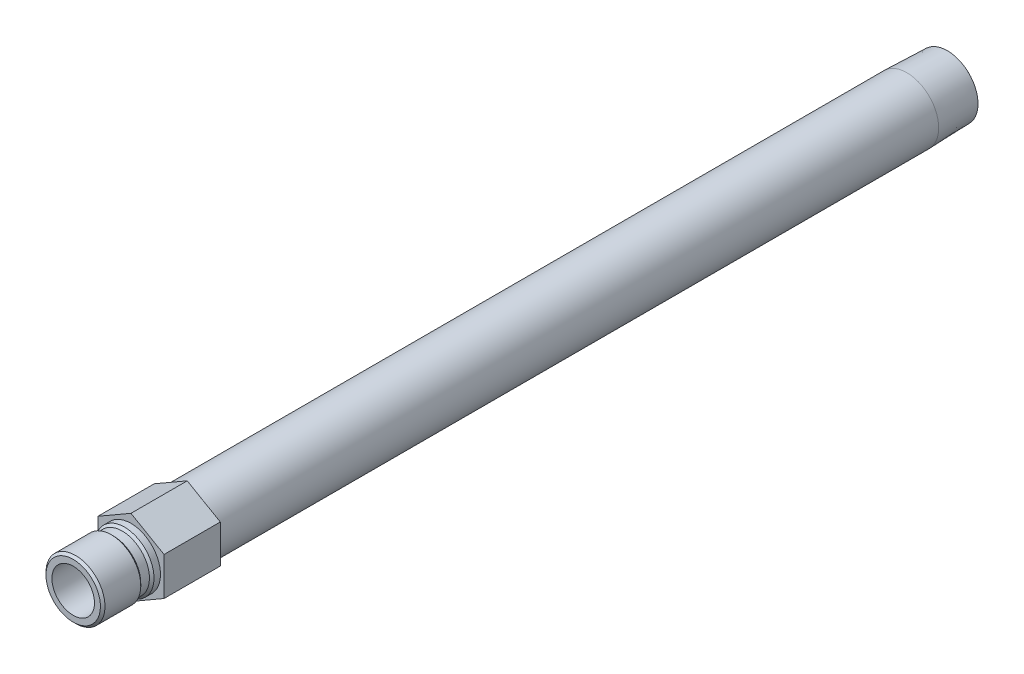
ISO-10303-21;
HEADER;
FILE_DESCRIPTION(('STEP AP214'),'2;1');
FILE_NAME('part.step','',(''),(''),'','','');
FILE_SCHEMA(('AUTOMOTIVE_DESIGN { 1 0 10303 214 1 1 1 1 }'));
ENDSEC;
DATA;
#1=APPLICATION_CONTEXT('core data for automotive mechanical design processes');
#2=APPLICATION_PROTOCOL_DEFINITION('international standard','automotive_design',2000,#1);
#3=PRODUCT_CONTEXT('',#1,'mechanical');
#4=PRODUCT('Part','Part','',(#3));
#5=PRODUCT_RELATED_PRODUCT_CATEGORY('part','',(#4));
#6=PRODUCT_DEFINITION_FORMATION('','',#4);
#7=PRODUCT_DEFINITION_CONTEXT('part definition',#1,'design');
#8=PRODUCT_DEFINITION('design','',#6,#7);
#9=PRODUCT_DEFINITION_SHAPE('','',#8);
#10=(LENGTH_UNIT() NAMED_UNIT(*) SI_UNIT(.MILLI.,.METRE.));
#11=(NAMED_UNIT(*) PLANE_ANGLE_UNIT() SI_UNIT($,.RADIAN.));
#12=(NAMED_UNIT(*) SI_UNIT($,.STERADIAN.) SOLID_ANGLE_UNIT());
#13=UNCERTAINTY_MEASURE_WITH_UNIT(LENGTH_MEASURE(1.E-05),#10,'distance_accuracy_value','');
#14=(GEOMETRIC_REPRESENTATION_CONTEXT(3) GLOBAL_UNCERTAINTY_ASSIGNED_CONTEXT((#13)) GLOBAL_UNIT_ASSIGNED_CONTEXT((#10,
#11,#12)) REPRESENTATION_CONTEXT('',''));
#15=CARTESIAN_POINT('',(0.,0.,0.));
#16=DIRECTION('',(0.,0.,1.));
#17=DIRECTION('',(1.,0.,0.));
#18=AXIS2_PLACEMENT_3D('',#15,#16,#17);
#19=CARTESIAN_POINT('',(0.,0.,0.));
#20=DIRECTION('',(0.,0.,-1.));
#21=DIRECTION('',(0.,1.,0.));
#22=AXIS2_PLACEMENT_3D('',#19,#20,#21);
#23=CYLINDRICAL_SURFACE('',#22,7.112);
#24=CARTESIAN_POINT('',(0.,0.,1.524));
#25=DIRECTION('',(0.,0.,-1.));
#26=DIRECTION('',(0.,1.,0.));
#27=AXIS2_PLACEMENT_3D('',#24,#25,#26);
#28=CIRCLE('',#27,7.112);
#29=CARTESIAN_POINT('',(0.,7.112,1.524));
#30=VERTEX_POINT('',#29);
#31=EDGE_CURVE('E147',#30,#30,#28,.T.);
#32=ORIENTED_EDGE('',*,*,#31,.T.);
#33=EDGE_LOOP('',(#32));
#34=FACE_BOUND('',#33,.T.);
#35=CARTESIAN_POINT('',(0.,0.,19.304));
#36=DIRECTION('',(0.,0.,-1.));
#37=DIRECTION('',(0.,1.,0.));
#38=AXIS2_PLACEMENT_3D('',#35,#36,#37);
#39=CIRCLE('',#38,7.112);
#40=CARTESIAN_POINT('',(0.,7.112,19.304));
#41=VERTEX_POINT('',#40);
#42=EDGE_CURVE('E42',#41,#41,#39,.T.);
#43=ORIENTED_EDGE('',*,*,#42,.F.);
#44=EDGE_LOOP('',(#43));
#45=FACE_BOUND('',#44,.T.);
#46=ADVANCED_FACE('F33',(#34,#45),#23,.F.);
#47=CARTESIAN_POINT('',(0.,7.112,19.304));
#48=DIRECTION('',(0.,0.,1.));
#49=DIRECTION('',(0.,-1.,0.));
#50=AXIS2_PLACEMENT_3D('',#47,#48,#49);
#51=PLANE('',#50);
#52=ORIENTED_EDGE('',*,*,#42,.T.);
#53=EDGE_LOOP('',(#52));
#54=FACE_BOUND('',#53,.T.);
#55=CARTESIAN_POINT('',(0.,0.,19.304));
#56=DIRECTION('',(0.,0.,-1.));
#57=DIRECTION('',(0.,1.,0.));
#58=AXIS2_PLACEMENT_3D('',#55,#56,#57);
#59=CIRCLE('',#58,9.0932);
#60=CARTESIAN_POINT('',(0.,9.0932,19.304));
#61=VERTEX_POINT('',#60);
#62=EDGE_CURVE('E180',#61,#61,#59,.T.);
#63=ORIENTED_EDGE('',*,*,#62,.F.);
#64=EDGE_LOOP('',(#63));
#65=FACE_BOUND('',#64,.T.);
#66=ADVANCED_FACE('F186',(#54,#65),#51,.T.);
#67=CARTESIAN_POINT('',(0.,0.,18.542));
#68=DIRECTION('',(0.,0.,-1.));
#69=DIRECTION('',(0.,1.,0.));
#70=AXIS2_PLACEMENT_3D('',#67,#68,#69);
#71=CONICAL_SURFACE('',#70,9.8552,0.785398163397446);
#72=ORIENTED_EDGE('',*,*,#62,.T.);
#73=EDGE_LOOP('',(#72));
#74=FACE_BOUND('',#73,.T.);
#75=CARTESIAN_POINT('',(0.,0.,18.542));
#76=DIRECTION('',(0.,0.,-1.));
#77=DIRECTION('',(0.,1.,0.));
#78=AXIS2_PLACEMENT_3D('',#75,#76,#77);
#79=CIRCLE('',#78,9.8552);
#80=CARTESIAN_POINT('',(0.,9.8552,18.542));
#81=VERTEX_POINT('',#80);
#82=EDGE_CURVE('E177',#81,#81,#79,.T.);
#83=ORIENTED_EDGE('',*,*,#82,.F.);
#84=EDGE_LOOP('',(#83));
#85=FACE_BOUND('',#84,.T.);
#86=ADVANCED_FACE('F194',(#74,#85),#71,.T.);
#87=CARTESIAN_POINT('',(0.,0.,0.));
#88=DIRECTION('',(0.,0.,-1.));
#89=DIRECTION('',(0.,1.,0.));
#90=AXIS2_PLACEMENT_3D('',#87,#88,#89);
#91=CYLINDRICAL_SURFACE('',#90,9.8552);
#92=ORIENTED_EDGE('',*,*,#82,.T.);
#93=EDGE_LOOP('',(#92));
#94=FACE_BOUND('',#93,.T.);
#95=CARTESIAN_POINT('',(0.,0.,6.5786));
#96=DIRECTION('',(0.,0.,-1.));
#97=DIRECTION('',(0.,1.,0.));
#98=AXIS2_PLACEMENT_3D('',#95,#96,#97);
#99=CIRCLE('',#98,9.8552);
#100=CARTESIAN_POINT('',(0.,9.8552,6.5786));
#101=VERTEX_POINT('',#100);
#102=EDGE_CURVE('E174',#101,#101,#99,.T.);
#103=ORIENTED_EDGE('',*,*,#102,.F.);
#104=EDGE_LOOP('',(#103));
#105=FACE_BOUND('',#104,.T.);
#106=ADVANCED_FACE('F249',(#94,#105),#91,.T.);
#107=CARTESIAN_POINT('',(0.,0.,5.8166));
#108=DIRECTION('',(0.,0.,1.));
#109=DIRECTION('',(0.,-1.,0.));
#110=AXIS2_PLACEMENT_3D('',#107,#108,#109);
#111=CONICAL_SURFACE('',#110,9.0932,0.785398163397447);
#112=ORIENTED_EDGE('',*,*,#102,.T.);
#113=EDGE_LOOP('',(#112));
#114=FACE_BOUND('',#113,.T.);
#115=CARTESIAN_POINT('',(0.,0.,5.8166));
#116=DIRECTION('',(0.,0.,-1.));
#117=DIRECTION('',(0.,1.,0.));
#118=AXIS2_PLACEMENT_3D('',#115,#116,#117);
#119=CIRCLE('',#118,9.0932);
#120=CARTESIAN_POINT('',(0.,9.0932,5.8166));
#121=VERTEX_POINT('',#120);
#122=EDGE_CURVE('E171',#121,#121,#119,.T.);
#123=ORIENTED_EDGE('',*,*,#122,.F.);
#124=EDGE_LOOP('',(#123));
#125=FACE_BOUND('',#124,.T.);
#126=ADVANCED_FACE('F245',(#114,#125),#111,.T.);
#127=CARTESIAN_POINT('',(0.,0.,0.));
#128=DIRECTION('',(0.,0.,-1.));
#129=DIRECTION('',(0.,1.,0.));
#130=AXIS2_PLACEMENT_3D('',#127,#128,#129);
#131=CYLINDRICAL_SURFACE('',#130,9.0932);
#132=ORIENTED_EDGE('',*,*,#122,.T.);
#133=EDGE_LOOP('',(#132));
#134=FACE_BOUND('',#133,.T.);
#135=CARTESIAN_POINT('',(0.,0.,2.921));
#136=DIRECTION('',(0.,0.,-1.));
#137=DIRECTION('',(0.,1.,0.));
#138=AXIS2_PLACEMENT_3D('',#135,#136,#137);
#139=CIRCLE('',#138,9.0932);
#140=CARTESIAN_POINT('',(0.,9.0932,2.921));
#141=VERTEX_POINT('',#140);
#142=EDGE_CURVE('E168',#141,#141,#139,.T.);
#143=ORIENTED_EDGE('',*,*,#142,.F.);
#144=EDGE_LOOP('',(#143));
#145=FACE_BOUND('',#144,.T.);
#146=ADVANCED_FACE('F241',(#134,#145),#131,.T.);
#147=CARTESIAN_POINT('',(0.,0.,2.159));
#148=DIRECTION('',(0.,0.,-1.));
#149=DIRECTION('',(0.,1.,0.));
#150=AXIS2_PLACEMENT_3D('',#147,#148,#149);
#151=CONICAL_SURFACE('',#150,9.8552,0.785398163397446);
#152=ORIENTED_EDGE('',*,*,#142,.T.);
#153=EDGE_LOOP('',(#152));
#154=FACE_BOUND('',#153,.T.);
#155=CARTESIAN_POINT('',(0.,0.,2.159));
#156=DIRECTION('',(0.,0.,-1.));
#157=DIRECTION('',(0.,1.,0.));
#158=AXIS2_PLACEMENT_3D('',#155,#156,#157);
#159=CIRCLE('',#158,9.8552);
#160=CARTESIAN_POINT('',(0.,9.8552,2.159));
#161=VERTEX_POINT('',#160);
#162=EDGE_CURVE('E165',#161,#161,#159,.T.);
#163=ORIENTED_EDGE('',*,*,#162,.F.);
#164=EDGE_LOOP('',(#163));
#165=FACE_BOUND('',#164,.T.);
#166=ADVANCED_FACE('F237',(#154,#165),#151,.T.);
#167=CARTESIAN_POINT('',(0.,0.,0.));
#168=DIRECTION('',(0.,0.,-1.));
#169=DIRECTION('',(0.,1.,0.));
#170=AXIS2_PLACEMENT_3D('',#167,#168,#169);
#171=CYLINDRICAL_SURFACE('',#170,9.8552);
#172=ORIENTED_EDGE('',*,*,#162,.T.);
#173=EDGE_LOOP('',(#172));
#174=FACE_BOUND('',#173,.T.);
#175=CARTESIAN_POINT('',(0.,0.,0.));
#176=DIRECTION('',(0.,0.,-1.));
#177=DIRECTION('',(0.,1.,0.));
#178=AXIS2_PLACEMENT_3D('',#175,#176,#177);
#179=CIRCLE('',#178,9.8552);
#180=CARTESIAN_POINT('',(0.,9.8552,0.));
#181=VERTEX_POINT('',#180);
#182=EDGE_CURVE('E162',#181,#181,#179,.T.);
#183=ORIENTED_EDGE('',*,*,#182,.F.);
#184=EDGE_LOOP('',(#183));
#185=FACE_BOUND('',#184,.T.);
#186=ADVANCED_FACE('F233',(#174,#185),#171,.T.);
#187=CARTESIAN_POINT('',(0.,9.8552,0.));
#188=DIRECTION('',(0.,0.,1.));
#189=DIRECTION('',(0.,-1.,0.));
#190=AXIS2_PLACEMENT_3D('',#187,#188,#189);
#191=PLANE('',#190);
#192=ORIENTED_EDGE('',*,*,#182,.T.);
#193=EDGE_LOOP('',(#192));
#194=FACE_BOUND('',#193,.T.);
#195=DIRECTION('',(-0.866025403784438,-0.5,0.));
#196=VECTOR('',#195,1.);
#197=CARTESIAN_POINT('',(0.,12.7582862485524,0.));
#198=LINE('',#197,#196);
#199=CARTESIAN_POINT('',(0.,12.7582862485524,0.));
#200=VERTEX_POINT('',#199);
#201=CARTESIAN_POINT('',(-11.049,6.37914312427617,0.));
#202=VERTEX_POINT('',#201);
#203=EDGE_CURVE('E121',#200,#202,#198,.T.);
#204=ORIENTED_EDGE('',*,*,#203,.T.);
#205=DIRECTION('',(0.,-1.,0.));
#206=VECTOR('',#205,1.);
#207=CARTESIAN_POINT('',(-11.049,6.37914312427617,0.));
#208=LINE('',#207,#206);
#209=CARTESIAN_POINT('',(-11.049,-6.37914312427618,0.));
#210=VERTEX_POINT('',#209);
#211=EDGE_CURVE('E124',#202,#210,#208,.T.);
#212=ORIENTED_EDGE('',*,*,#211,.T.);
#213=DIRECTION('',(0.866025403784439,-0.5,0.));
#214=VECTOR('',#213,1.);
#215=CARTESIAN_POINT('',(-11.049,-6.37914312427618,0.));
#216=LINE('',#215,#214);
#217=CARTESIAN_POINT('',(0.,-12.7582862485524,0.));
#218=VERTEX_POINT('',#217);
#219=EDGE_CURVE('E128',#210,#218,#216,.T.);
#220=ORIENTED_EDGE('',*,*,#219,.T.);
#221=DIRECTION('',(0.866025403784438,0.5,0.));
#222=VECTOR('',#221,1.);
#223=CARTESIAN_POINT('',(0.,-12.7582862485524,0.));
#224=LINE('',#223,#222);
#225=CARTESIAN_POINT('',(11.049,-6.37914312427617,0.));
#226=VERTEX_POINT('',#225);
#227=EDGE_CURVE('E131',#218,#226,#224,.T.);
#228=ORIENTED_EDGE('',*,*,#227,.T.);
#229=DIRECTION('',(0.,1.,0.));
#230=VECTOR('',#229,1.);
#231=CARTESIAN_POINT('',(11.049,-6.37914312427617,0.));
#232=LINE('',#231,#230);
#233=CARTESIAN_POINT('',(11.049,6.37914312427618,0.));
#234=VERTEX_POINT('',#233);
#235=EDGE_CURVE('E98',#226,#234,#232,.T.);
#236=ORIENTED_EDGE('',*,*,#235,.T.);
#237=DIRECTION('',(-0.866025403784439,0.5,0.));
#238=VECTOR('',#237,1.);
#239=CARTESIAN_POINT('',(11.049,6.37914312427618,0.));
#240=LINE('',#239,#238);
#241=EDGE_CURVE('E134',#234,#200,#240,.T.);
#242=ORIENTED_EDGE('',*,*,#241,.T.);
#243=EDGE_LOOP('',(#204,#212,#220,#228,#236,#242));
#244=FACE_BOUND('',#243,.T.);
#245=ADVANCED_FACE('F210',(#194,#244),#191,.T.);
#246=CARTESIAN_POINT('',(0.,0.,0.));
#247=DIRECTION('',(0.,0.,-1.));
#248=DIRECTION('',(0.,1.,0.));
#249=AXIS2_PLACEMENT_3D('',#246,#247,#248);
#250=CYLINDRICAL_SURFACE('',#249,7.89939999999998);
#251=CARTESIAN_POINT('',(0.,0.,0.));
#252=DIRECTION('',(0.,0.,1.));
#253=DIRECTION('',(1.,0.,0.));
#254=AXIS2_PLACEMENT_3D('',#251,#252,#253);
#255=CIRCLE('',#254,7.89939999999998);
#256=CARTESIAN_POINT('',(7.89939999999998,0.,0.));
#257=VERTEX_POINT('',#256);
#258=EDGE_CURVE('E11',#257,#257,#255,.T.);
#259=ORIENTED_EDGE('',*,*,#258,.F.);
#260=EDGE_LOOP('',(#259));
#261=FACE_BOUND('',#260,.T.);
#262=CARTESIAN_POINT('',(0.,0.,1.10533199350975));
#263=DIRECTION('',(0.,0.,-1.));
#264=DIRECTION('',(0.,1.,0.));
#265=AXIS2_PLACEMENT_3D('',#262,#263,#264);
#266=CIRCLE('',#265,7.8994);
#267=CARTESIAN_POINT('',(0.,7.8994,1.10533199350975));
#268=VERTEX_POINT('',#267);
#269=EDGE_CURVE('E150',#268,#268,#266,.T.);
#270=ORIENTED_EDGE('',*,*,#269,.F.);
#271=EDGE_LOOP('',(#270));
#272=FACE_BOUND('',#271,.T.);
#273=ADVANCED_FACE('F200',(#261,#272),#250,.F.);
#274=CARTESIAN_POINT('',(0.,0.,1.524));
#275=DIRECTION('',(0.,0.,-1.));
#276=DIRECTION('',(0.,1.,0.));
#277=AXIS2_PLACEMENT_3D('',#274,#275,#276);
#278=CONICAL_SURFACE('',#277,7.112,1.08210413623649);
#279=ORIENTED_EDGE('',*,*,#269,.T.);
#280=EDGE_LOOP('',(#279));
#281=FACE_BOUND('',#280,.T.);
#282=ORIENTED_EDGE('',*,*,#31,.F.);
#283=EDGE_LOOP('',(#282));
#284=FACE_BOUND('',#283,.T.);
#285=ADVANCED_FACE('F197',(#281,#284),#278,.F.);
#286=CARTESIAN_POINT('',(-11.049,6.37914312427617,-18.796));
#287=DIRECTION('',(0.,0.,1.));
#288=DIRECTION('',(1.,0.,0.));
#289=AXIS2_PLACEMENT_3D('',#286,#287,#288);
#290=PLANE('',#289);
#291=CARTESIAN_POINT('',(0.,0.,-18.796));
#292=DIRECTION('',(0.,0.,1.));
#293=DIRECTION('',(1.,0.,0.));
#294=AXIS2_PLACEMENT_3D('',#291,#292,#293);
#295=CIRCLE('',#294,7.89939999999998);
#296=CARTESIAN_POINT('',(7.89939999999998,0.,-18.796));
#297=VERTEX_POINT('',#296);
#298=EDGE_CURVE('E36',#297,#297,#295,.T.);
#299=ORIENTED_EDGE('',*,*,#298,.F.);
#300=EDGE_LOOP('',(#299));
#301=FACE_BOUND('',#300,.T.);
#302=CARTESIAN_POINT('',(0.,0.,-18.796));
#303=DIRECTION('',(0.,0.,1.));
#304=DIRECTION('',(1.,0.,0.));
#305=AXIS2_PLACEMENT_3D('',#302,#303,#304);
#306=CIRCLE('',#305,7.112);
#307=CARTESIAN_POINT('',(7.112,0.,-18.796));
#308=VERTEX_POINT('',#307);
#309=EDGE_CURVE('E125',#308,#308,#306,.T.);
#310=ORIENTED_EDGE('',*,*,#309,.T.);
#311=EDGE_LOOP('',(#310));
#312=FACE_BOUND('',#311,.T.);
#313=ADVANCED_FACE('F199',(#301,#312),#290,.F.);
#314=CARTESIAN_POINT('',(0.,0.,-18.796));
#315=DIRECTION('',(0.,0.,1.));
#316=DIRECTION('',(1.,0.,0.));
#317=AXIS2_PLACEMENT_3D('',#314,#315,#316);
#318=CYLINDRICAL_SURFACE('',#317,7.112);
#319=ORIENTED_EDGE('',*,*,#309,.F.);
#320=EDGE_LOOP('',(#319));
#321=FACE_BOUND('',#320,.T.);
#322=CARTESIAN_POINT('',(0.,0.,0.));
#323=DIRECTION('',(0.,0.,1.));
#324=DIRECTION('',(1.,0.,0.));
#325=AXIS2_PLACEMENT_3D('',#322,#323,#324);
#326=CIRCLE('',#325,7.112);
#327=CARTESIAN_POINT('',(7.112,0.,0.));
#328=VERTEX_POINT('',#327);
#329=EDGE_CURVE('E443',#328,#328,#326,.T.);
#330=ORIENTED_EDGE('',*,*,#329,.T.);
#331=EDGE_LOOP('',(#330));
#332=FACE_BOUND('',#331,.T.);
#333=ADVANCED_FACE('F207',(#321,#332),#318,.F.);
#334=CARTESIAN_POINT('',(-11.049,6.37914312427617,0.));
#335=DIRECTION('',(0.,0.,1.));
#336=DIRECTION('',(1.,0.,0.));
#337=AXIS2_PLACEMENT_3D('',#334,#335,#336);
#338=PLANE('',#337);
#339=ORIENTED_EDGE('',*,*,#258,.T.);
#340=EDGE_LOOP('',(#339));
#341=FACE_BOUND('',#340,.T.);
#342=ORIENTED_EDGE('',*,*,#329,.F.);
#343=EDGE_LOOP('',(#342));
#344=FACE_BOUND('',#343,.T.);
#345=ADVANCED_FACE('F221',(#341,#344),#338,.T.);
#346=CARTESIAN_POINT('',(0.,10.244140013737,-272.796));
#347=DIRECTION('',(0.,0.,-1.));
#348=DIRECTION('',(0.,1.,0.));
#349=AXIS2_PLACEMENT_3D('',#346,#347,#348);
#350=PLANE('',#349);
#351=CARTESIAN_POINT('',(0.,0.,-272.796));
#352=DIRECTION('',(0.,0.,-1.));
#353=DIRECTION('',(0.,1.,0.));
#354=AXIS2_PLACEMENT_3D('',#351,#352,#353);
#355=CIRCLE('',#354,10.2441400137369);
#356=CARTESIAN_POINT('',(0.,10.244140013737,-272.796));
#357=VERTEX_POINT('',#356);
#358=EDGE_CURVE('E156',#357,#357,#355,.T.);
#359=ORIENTED_EDGE('',*,*,#358,.T.);
#360=EDGE_LOOP('',(#359));
#361=FACE_BOUND('',#360,.T.);
#362=CARTESIAN_POINT('',(0.,0.,-272.796));
#363=DIRECTION('',(0.,0.,-1.));
#364=DIRECTION('',(0.,1.,0.));
#365=AXIS2_PLACEMENT_3D('',#362,#363,#364);
#366=CIRCLE('',#365,7.89939999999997);
#367=CARTESIAN_POINT('',(0.,7.8994,-272.796));
#368=VERTEX_POINT('',#367);
#369=EDGE_CURVE('E153',#368,#368,#366,.T.);
#370=ORIENTED_EDGE('',*,*,#369,.F.);
#371=EDGE_LOOP('',(#370));
#372=FACE_BOUND('',#371,.T.);
#373=ADVANCED_FACE('F218',(#361,#372),#350,.T.);
#374=ORIENTED_EDGE('',*,*,#369,.T.);
#375=EDGE_LOOP('',(#374));
#376=FACE_BOUND('',#375,.T.);
#377=ORIENTED_EDGE('',*,*,#298,.T.);
#378=EDGE_LOOP('',(#377));
#379=FACE_BOUND('',#378,.T.);
#380=ADVANCED_FACE('F213',(#376,#379),#250,.F.);
#381=CARTESIAN_POINT('',(0.,0.,-272.796));
#382=DIRECTION('',(0.,0.,1.));
#383=DIRECTION('',(0.,-1.,0.));
#384=AXIS2_PLACEMENT_3D('',#381,#382,#383);
#385=CONICAL_SURFACE('',#384,10.2441400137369,0.0312396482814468);
#386=CARTESIAN_POINT('',(0.,0.,-259.2324));
#387=DIRECTION('',(0.,0.,-1.));
#388=DIRECTION('',(0.,1.,0.));
#389=AXIS2_PLACEMENT_3D('',#386,#387,#388);
#390=CIRCLE('',#389,10.668);
#391=CARTESIAN_POINT('',(0.,10.668,-259.2324));
#392=VERTEX_POINT('',#391);
#393=EDGE_CURVE('E159',#392,#392,#390,.T.);
#394=ORIENTED_EDGE('',*,*,#393,.T.);
#395=EDGE_LOOP('',(#394));
#396=FACE_BOUND('',#395,.T.);
#397=ORIENTED_EDGE('',*,*,#358,.F.);
#398=EDGE_LOOP('',(#397));
#399=FACE_BOUND('',#398,.T.);
#400=ADVANCED_FACE('F223',(#396,#399),#385,.T.);
#401=CARTESIAN_POINT('',(0.,0.,0.));
#402=DIRECTION('',(0.,0.,-1.));
#403=DIRECTION('',(0.,1.,0.));
#404=AXIS2_PLACEMENT_3D('',#401,#402,#403);
#405=CYLINDRICAL_SURFACE('',#404,10.668);
#406=ORIENTED_EDGE('',*,*,#393,.F.);
#407=EDGE_LOOP('',(#406));
#408=FACE_BOUND('',#407,.T.);
#409=CARTESIAN_POINT('',(0.,0.,-18.796));
#410=DIRECTION('',(0.,0.,1.));
#411=DIRECTION('',(1.,0.,0.));
#412=AXIS2_PLACEMENT_3D('',#409,#410,#411);
#413=CIRCLE('',#412,10.668);
#414=CARTESIAN_POINT('',(10.668,0.,-18.796));
#415=VERTEX_POINT('',#414);
#416=EDGE_CURVE('E144',#415,#415,#413,.F.);
#417=ORIENTED_EDGE('',*,*,#416,.T.);
#418=EDGE_LOOP('',(#417));
#419=FACE_BOUND('',#418,.T.);
#420=ADVANCED_FACE('F226',(#408,#419),#405,.T.);
#421=ORIENTED_EDGE('',*,*,#416,.F.);
#422=EDGE_LOOP('',(#421));
#423=FACE_BOUND('',#422,.T.);
#424=DIRECTION('',(-0.866025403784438,-0.5,0.));
#425=VECTOR('',#424,1.);
#426=CARTESIAN_POINT('',(0.,12.7582862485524,-18.796));
#427=LINE('',#426,#425);
#428=CARTESIAN_POINT('',(0.,12.7582862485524,-18.796));
#429=VERTEX_POINT('',#428);
#430=CARTESIAN_POINT('',(-11.049,6.37914312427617,-18.796));
#431=VERTEX_POINT('',#430);
#432=EDGE_CURVE('E137',#429,#431,#427,.T.);
#433=ORIENTED_EDGE('',*,*,#432,.F.);
#434=DIRECTION('',(-0.866025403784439,0.5,0.));
#435=VECTOR('',#434,1.);
#436=CARTESIAN_POINT('',(11.049,6.37914312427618,-18.796));
#437=LINE('',#436,#435);
#438=CARTESIAN_POINT('',(11.049,6.37914312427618,-18.796));
#439=VERTEX_POINT('',#438);
#440=EDGE_CURVE('E111',#439,#429,#437,.T.);
#441=ORIENTED_EDGE('',*,*,#440,.F.);
#442=DIRECTION('',(0.,1.,0.));
#443=VECTOR('',#442,1.);
#444=CARTESIAN_POINT('',(11.049,-6.37914312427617,-18.796));
#445=LINE('',#444,#443);
#446=CARTESIAN_POINT('',(11.049,-6.37914312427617,-18.796));
#447=VERTEX_POINT('',#446);
#448=EDGE_CURVE('E96',#447,#439,#445,.T.);
#449=ORIENTED_EDGE('',*,*,#448,.F.);
#450=DIRECTION('',(0.866025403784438,0.5,0.));
#451=VECTOR('',#450,1.);
#452=CARTESIAN_POINT('',(0.,-12.7582862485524,-18.796));
#453=LINE('',#452,#451);
#454=CARTESIAN_POINT('',(0.,-12.7582862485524,-18.796));
#455=VERTEX_POINT('',#454);
#456=EDGE_CURVE('E109',#455,#447,#453,.T.);
#457=ORIENTED_EDGE('',*,*,#456,.F.);
#458=DIRECTION('',(0.866025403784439,-0.5,0.));
#459=VECTOR('',#458,1.);
#460=CARTESIAN_POINT('',(-11.049,-6.37914312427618,-18.796));
#461=LINE('',#460,#459);
#462=CARTESIAN_POINT('',(-11.049,-6.37914312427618,-18.796));
#463=VERTEX_POINT('',#462);
#464=EDGE_CURVE('E114',#463,#455,#461,.T.);
#465=ORIENTED_EDGE('',*,*,#464,.F.);
#466=DIRECTION('',(0.,-1.,0.));
#467=VECTOR('',#466,1.);
#468=CARTESIAN_POINT('',(-11.049,6.37914312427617,-18.796));
#469=LINE('',#468,#467);
#470=EDGE_CURVE('E116',#431,#463,#469,.T.);
#471=ORIENTED_EDGE('',*,*,#470,.F.);
#472=EDGE_LOOP('',(#433,#441,#449,#457,#465,#471));
#473=FACE_BOUND('',#472,.T.);
#474=ADVANCED_FACE('F107',(#423,#473),#290,.F.);
#475=CARTESIAN_POINT('',(0.,12.7582862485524,-18.796));
#476=DIRECTION('',(-0.5,0.866025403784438,0.));
#477=DIRECTION('',(-0.866025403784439,-0.5,0.));
#478=AXIS2_PLACEMENT_3D('',#475,#476,#477);
#479=PLANE('',#478);
#480=ORIENTED_EDGE('',*,*,#203,.F.);
#481=DIRECTION('',(0.,0.,1.));
#482=VECTOR('',#481,1.);
#483=CARTESIAN_POINT('',(0.,12.7582862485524,-18.796));
#484=LINE('',#483,#482);
#485=EDGE_CURVE('E50',#429,#200,#484,.T.);
#486=ORIENTED_EDGE('',*,*,#485,.F.);
#487=ORIENTED_EDGE('',*,*,#432,.T.);
#488=DIRECTION('',(0.,0.,1.));
#489=VECTOR('',#488,1.);
#490=CARTESIAN_POINT('',(-11.049,6.37914312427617,-18.796));
#491=LINE('',#490,#489);
#492=EDGE_CURVE('E85',#431,#202,#491,.T.);
#493=ORIENTED_EDGE('',*,*,#492,.T.);
#494=EDGE_LOOP('',(#480,#486,#487,#493));
#495=FACE_BOUND('',#494,.T.);
#496=ADVANCED_FACE('F215',(#495),#479,.T.);
#497=CARTESIAN_POINT('',(11.049,6.37914312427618,-18.796));
#498=DIRECTION('',(0.5,0.866025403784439,0.));
#499=DIRECTION('',(-0.866025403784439,0.5,0.));
#500=AXIS2_PLACEMENT_3D('',#497,#498,#499);
#501=PLANE('',#500);
#502=ORIENTED_EDGE('',*,*,#241,.F.);
#503=DIRECTION('',(0.,0.,1.));
#504=VECTOR('',#503,1.);
#505=CARTESIAN_POINT('',(11.049,6.37914312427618,-18.796));
#506=LINE('',#505,#504);
#507=EDGE_CURVE('E73',#439,#234,#506,.T.);
#508=ORIENTED_EDGE('',*,*,#507,.F.);
#509=ORIENTED_EDGE('',*,*,#440,.T.);
#510=ORIENTED_EDGE('',*,*,#485,.T.);
#511=EDGE_LOOP('',(#502,#508,#509,#510));
#512=FACE_BOUND('',#511,.T.);
#513=ADVANCED_FACE('F276',(#512),#501,.T.);
#514=CARTESIAN_POINT('',(11.049,-6.37914312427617,-18.796));
#515=DIRECTION('',(1.,0.,0.));
#516=DIRECTION('',(0.,1.,0.));
#517=AXIS2_PLACEMENT_3D('',#514,#515,#516);
#518=PLANE('',#517);
#519=ORIENTED_EDGE('',*,*,#235,.F.);
#520=DIRECTION('',(0.,0.,1.));
#521=VECTOR('',#520,1.);
#522=CARTESIAN_POINT('',(11.049,-6.37914312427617,-18.796));
#523=LINE('',#522,#521);
#524=EDGE_CURVE('E93',#447,#226,#523,.T.);
#525=ORIENTED_EDGE('',*,*,#524,.F.);
#526=ORIENTED_EDGE('',*,*,#448,.T.);
#527=ORIENTED_EDGE('',*,*,#507,.T.);
#528=EDGE_LOOP('',(#519,#525,#526,#527));
#529=FACE_BOUND('',#528,.T.);
#530=ADVANCED_FACE('F95',(#529),#518,.T.);
#531=CARTESIAN_POINT('',(0.,-12.7582862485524,-18.796));
#532=DIRECTION('',(0.5,-0.866025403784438,0.));
#533=DIRECTION('',(0.866025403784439,0.5,0.));
#534=AXIS2_PLACEMENT_3D('',#531,#532,#533);
#535=PLANE('',#534);
#536=ORIENTED_EDGE('',*,*,#227,.F.);
#537=DIRECTION('',(0.,0.,1.));
#538=VECTOR('',#537,1.);
#539=CARTESIAN_POINT('',(0.,-12.7582862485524,-18.796));
#540=LINE('',#539,#538);
#541=EDGE_CURVE('E103',#455,#218,#540,.T.);
#542=ORIENTED_EDGE('',*,*,#541,.F.);
#543=ORIENTED_EDGE('',*,*,#456,.T.);
#544=ORIENTED_EDGE('',*,*,#524,.T.);
#545=EDGE_LOOP('',(#536,#542,#543,#544));
#546=FACE_BOUND('',#545,.T.);
#547=ADVANCED_FACE('F113',(#546),#535,.T.);
#548=CARTESIAN_POINT('',(-11.049,-6.37914312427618,-18.796));
#549=DIRECTION('',(-0.5,-0.866025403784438,0.));
#550=DIRECTION('',(0.866025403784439,-0.5,0.));
#551=AXIS2_PLACEMENT_3D('',#548,#549,#550);
#552=PLANE('',#551);
#553=ORIENTED_EDGE('',*,*,#219,.F.);
#554=DIRECTION('',(0.,0.,1.));
#555=VECTOR('',#554,1.);
#556=CARTESIAN_POINT('',(-11.049,-6.37914312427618,-18.796));
#557=LINE('',#556,#555);
#558=EDGE_CURVE('E141',#463,#210,#557,.T.);
#559=ORIENTED_EDGE('',*,*,#558,.F.);
#560=ORIENTED_EDGE('',*,*,#464,.T.);
#561=ORIENTED_EDGE('',*,*,#541,.T.);
#562=EDGE_LOOP('',(#553,#559,#560,#561));
#563=FACE_BOUND('',#562,.T.);
#564=ADVANCED_FACE('F275',(#563),#552,.T.);
#565=CARTESIAN_POINT('',(-11.049,6.37914312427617,-18.796));
#566=DIRECTION('',(-1.,0.,0.));
#567=DIRECTION('',(0.,0.,1.));
#568=AXIS2_PLACEMENT_3D('',#565,#566,#567);
#569=PLANE('',#568);
#570=ORIENTED_EDGE('',*,*,#211,.F.);
#571=ORIENTED_EDGE('',*,*,#492,.F.);
#572=ORIENTED_EDGE('',*,*,#470,.T.);
#573=ORIENTED_EDGE('',*,*,#558,.T.);
#574=EDGE_LOOP('',(#570,#571,#572,#573));
#575=FACE_BOUND('',#574,.T.);
#576=ADVANCED_FACE('F272',(#575),#569,.T.);
#577=CLOSED_SHELL('',(#46,#66,#86,#106,#126,#146,#166,#186,#245,#273,#285,#313,#333,#345,#373,
#380,#400,#420,#474,#496,#513,#530,#547,#564,#576));
#578=MANIFOLD_SOLID_BREP('B2',#577);
#579=ADVANCED_BREP_SHAPE_REPRESENTATION('',(#18,#578),#14);
#580=SHAPE_DEFINITION_REPRESENTATION(#9,#579);
ENDSEC;
END-ISO-10303-21;
